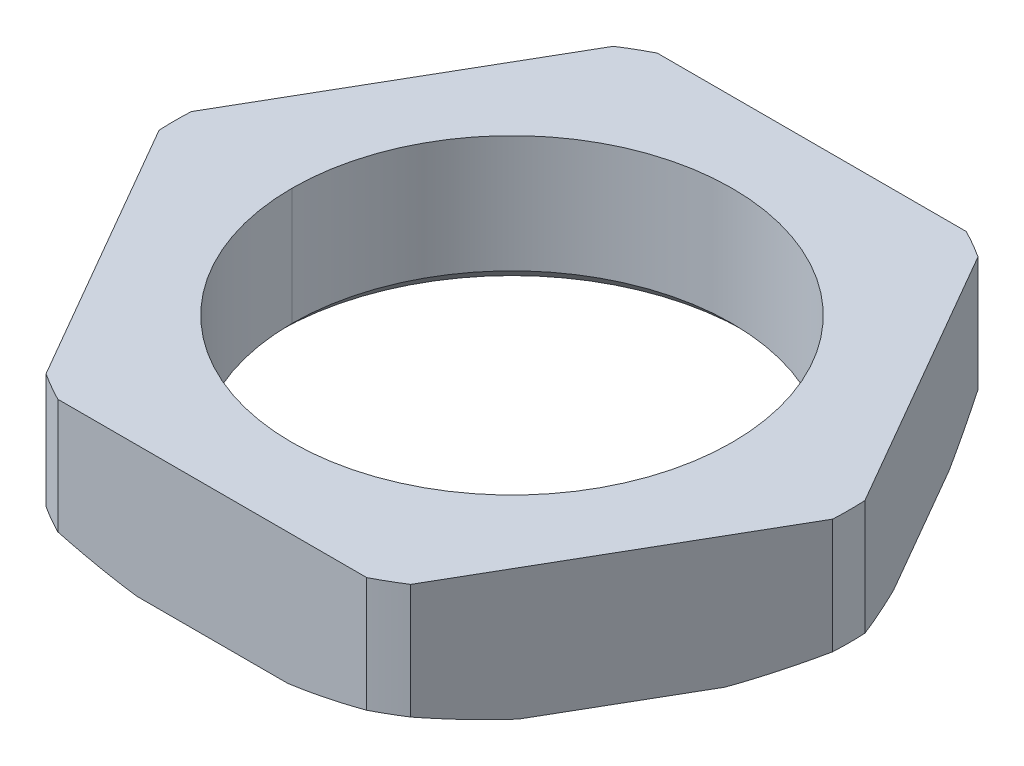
ISO-10303-21;
HEADER;
FILE_DESCRIPTION(('STEP AP214'),'2;1');
FILE_NAME('part.step','',(''),(''),'','','');
FILE_SCHEMA(('AUTOMOTIVE_DESIGN { 1 0 10303 214 1 1 1 1 }'));
ENDSEC;
DATA;
#1=APPLICATION_CONTEXT('core data for automotive mechanical design processes');
#2=APPLICATION_PROTOCOL_DEFINITION('international standard','automotive_design',2000,#1);
#3=PRODUCT_CONTEXT('',#1,'mechanical');
#4=PRODUCT('Part','Part','',(#3));
#5=PRODUCT_RELATED_PRODUCT_CATEGORY('part','',(#4));
#6=PRODUCT_DEFINITION_FORMATION('','',#4);
#7=PRODUCT_DEFINITION_CONTEXT('part definition',#1,'design');
#8=PRODUCT_DEFINITION('design','',#6,#7);
#9=PRODUCT_DEFINITION_SHAPE('','',#8);
#10=(LENGTH_UNIT() NAMED_UNIT(*) SI_UNIT(.MILLI.,.METRE.));
#11=(NAMED_UNIT(*) PLANE_ANGLE_UNIT() SI_UNIT($,.RADIAN.));
#12=(NAMED_UNIT(*) SI_UNIT($,.STERADIAN.) SOLID_ANGLE_UNIT());
#13=UNCERTAINTY_MEASURE_WITH_UNIT(LENGTH_MEASURE(1.E-05),#10,'distance_accuracy_value','');
#14=(GEOMETRIC_REPRESENTATION_CONTEXT(3) GLOBAL_UNCERTAINTY_ASSIGNED_CONTEXT((#13)) GLOBAL_UNIT_ASSIGNED_CONTEXT((#10,
#11,#12)) REPRESENTATION_CONTEXT('',''));
#15=CARTESIAN_POINT('',(0.,0.,0.));
#16=DIRECTION('',(0.,0.,1.));
#17=DIRECTION('',(1.,0.,0.));
#18=AXIS2_PLACEMENT_3D('',#15,#16,#17);
#19=CARTESIAN_POINT('',(0.,9.34123401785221,0.));
#20=DIRECTION('',(0.,1.,0.));
#21=DIRECTION('',(1.,0.,0.));
#22=AXIS2_PLACEMENT_3D('',#19,#20,#21);
#23=CONICAL_SURFACE('',#22,50.,1.0471975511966);
#24=CARTESIAN_POINT('',(-11.8408420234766,-9.99999999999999,-11.4910600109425));
#25=CARTESIAN_POINT('',(-11.7525857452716,-9.97510621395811,-11.6439179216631));
#26=CARTESIAN_POINT('',(-11.6644324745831,-9.94870526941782,-11.7965878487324));
#27=CARTESIAN_POINT('',(-11.4878805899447,-9.8928401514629,-12.1023559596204));
#28=CARTESIAN_POINT('',(-11.3994832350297,-9.86336015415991,-12.2554519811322));
#29=CARTESIAN_POINT('',(-11.2223159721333,-9.80133837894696,-12.5623156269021));
#30=CARTESIAN_POINT('',(-11.1335479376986,-9.76877616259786,-12.7160801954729));
#31=CARTESIAN_POINT('',(-10.9554968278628,-9.70059620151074,-13.0245042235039));
#32=CARTESIAN_POINT('',(-10.8662160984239,-9.66495407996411,-13.1791596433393));
#33=CARTESIAN_POINT('',(-10.690749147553,-9.59216920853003,-13.4830812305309));
#34=CARTESIAN_POINT('',(-10.6045546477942,-9.5551099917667,-13.6323626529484));
#35=CARTESIAN_POINT('',(-10.4317005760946,-9.47826049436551,-13.9317386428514));
#36=CARTESIAN_POINT('',(-10.3450433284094,-9.43844957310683,-14.0818292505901));
#37=CARTESIAN_POINT('',(-10.1711706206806,-9.35609995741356,-14.3829875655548));
#38=CARTESIAN_POINT('',(-10.0839578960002,-9.31353855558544,-14.5340506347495));
#39=CARTESIAN_POINT('',(-9.90888064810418,-9.22568968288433,-14.8373063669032));
#40=CARTESIAN_POINT('',(-9.82101918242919,-9.18037784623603,-14.9894937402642));
#41=CARTESIAN_POINT('',(-9.73330083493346,-9.13397459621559,-15.1414284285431));
#42=B_SPLINE_CURVE_WITH_KNOTS('',3,(#24,#25,#26,#27,#28,#29,#30,#31,#32,#33,#34,#35,#36,#37,#38,
#39,#40,#41),.UNSPECIFIED.,.F.,.F.,(4,2,2,2,2,2,2,2,4),(0.,0.53475236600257,1.07240246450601,
1.61390771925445,2.16018035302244,2.68911482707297,3.22257147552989,3.76120096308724,
4.30561448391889),.UNSPECIFIED.);
#43=CARTESIAN_POINT('',(-11.8408420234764,-10.,-11.4910600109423));
#44=VERTEX_POINT('',#43);
#45=CARTESIAN_POINT('',(-9.73330083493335,-9.13397459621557,-15.1414284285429));
#46=VERTEX_POINT('',#45);
#47=EDGE_CURVE('E639',#44,#46,#42,.T.);
#48=ORIENTED_EDGE('',*,*,#47,.T.);
#49=CARTESIAN_POINT('',(0.,-9.13397459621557,0.));
#50=DIRECTION('',(0.,-1.,0.));
#51=DIRECTION('',(1.,0.,0.));
#52=AXIS2_PLACEMENT_3D('',#49,#50,#51);
#53=CIRCLE('',#52,18.);
#54=CARTESIAN_POINT('',(-8.24621125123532,-9.13397459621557,-16.));
#55=VERTEX_POINT('',#54);
#56=EDGE_CURVE('E642',#46,#55,#53,.T.);
#57=ORIENTED_EDGE('',*,*,#56,.T.);
#58=CARTESIAN_POINT('',(-8.24621125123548,-9.13397459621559,-16.0000000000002));
#59=CARTESIAN_POINT('',(-8.07064932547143,-9.18041049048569,-15.9999989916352));
#60=CARTESIAN_POINT('',(-7.89479656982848,-9.22575332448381,-15.9999958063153));
#61=CARTESIAN_POINT('',(-7.54438070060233,-9.31366118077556,-15.9999898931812));
#62=CARTESIAN_POINT('',(-7.3698236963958,-9.3562505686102,-15.999987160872));
#63=CARTESIAN_POINT('',(-7.02182164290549,-9.43865311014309,-15.9999867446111));
#64=CARTESIAN_POINT('',(-6.84838197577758,-9.47848896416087,-15.9999890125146));
#65=CARTESIAN_POINT('',(-6.50242736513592,-9.55538547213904,-15.9999964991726));
#66=CARTESIAN_POINT('',(-6.32991700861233,-9.5924667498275,-16.0000016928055));
#67=CARTESIAN_POINT('',(-5.97898316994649,-9.66523594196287,-15.9999982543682));
#68=CARTESIAN_POINT('',(-5.80054315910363,-9.70084426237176,-15.9999891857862));
#69=CARTESIAN_POINT('',(-5.44468038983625,-9.7689615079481,-15.9999734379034));
#70=CARTESIAN_POINT('',(-5.26726227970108,-9.80149469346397,-15.9999667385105));
#71=CARTESIAN_POINT('',(-4.91318152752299,-9.86346347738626,-15.9999668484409));
#72=CARTESIAN_POINT('',(-4.73652244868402,-9.89291940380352,-15.9999735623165));
#73=CARTESIAN_POINT('',(-4.3836882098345,-9.94874139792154,-15.9999885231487));
#74=CARTESIAN_POINT('',(-4.20751553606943,-9.97512319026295,-15.9999967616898));
#75=CARTESIAN_POINT('',(-4.03112887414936,-9.99999999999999,-16.0000000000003));
#76=B_SPLINE_CURVE_WITH_KNOTS('',3,(#58,#59,#60,#61,#62,#63,#64,#65,#66,#67,#68,#69,#70,#71,#72,
#73,#74,#75),.UNSPECIFIED.,.F.,.F.,(4,2,2,2,2,2,2,2,4),(0.,0.544796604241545,1.08381372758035,
1.61766357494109,2.14699790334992,2.6928509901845,3.23395717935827,3.77122661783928,
4.30561449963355),.UNSPECIFIED.);
#77=CARTESIAN_POINT('',(-4.03112887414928,-10.,-16.));
#78=VERTEX_POINT('',#77);
#79=EDGE_CURVE('E461',#55,#78,#76,.T.);
#80=ORIENTED_EDGE('',*,*,#79,.T.);
#81=CARTESIAN_POINT('',(0.,-10.,0.));
#82=DIRECTION('',(0.,1.,0.));
#83=DIRECTION('',(1.,0.,0.));
#84=AXIS2_PLACEMENT_3D('',#81,#82,#83);
#85=CIRCLE('',#84,16.5);
#86=EDGE_CURVE('E437',#78,#44,#85,.T.);
#87=ORIENTED_EDGE('',*,*,#86,.T.);
#88=EDGE_LOOP('',(#48,#57,#80,#87));
#89=FACE_BOUND('',#88,.T.);
#90=ADVANCED_FACE('F15',(#89),#23,.T.);
#91=CARTESIAN_POINT('',(0.,9.34123401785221,0.));
#92=DIRECTION('',(0.,1.,0.));
#93=DIRECTION('',(1.,0.,0.));
#94=AXIS2_PLACEMENT_3D('',#91,#92,#93);
#95=CONICAL_SURFACE('',#94,50.,1.0471975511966);
#96=CARTESIAN_POINT('',(4.03112887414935,-9.99999999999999,-16.0000000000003));
#97=CARTESIAN_POINT('',(4.2044927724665,-9.97554947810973,-15.9999969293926));
#98=CARTESIAN_POINT('',(4.37765199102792,-9.94965752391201,-15.9999661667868));
#99=CARTESIAN_POINT('',(4.7242011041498,-9.89496824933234,-15.9998831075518));
#100=CARTESIAN_POINT('',(4.89758927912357,-9.86616002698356,-15.9998307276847));
#101=CARTESIAN_POINT('',(5.24484887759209,-9.80563960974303,-15.9997385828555));
#102=CARTESIAN_POINT('',(5.41871764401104,-9.77391218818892,-15.9996988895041));
#103=CARTESIAN_POINT('',(5.76718193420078,-9.70755842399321,-15.9996470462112));
#104=CARTESIAN_POINT('',(5.9417738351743,-9.67291307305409,-15.9996350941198));
#105=CARTESIAN_POINT('',(6.29191618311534,-9.60072684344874,-15.9996420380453));
#106=CARTESIAN_POINT('',(6.4674620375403,-9.56316371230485,-15.99966119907));
#107=CARTESIAN_POINT('',(6.81973260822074,-9.48514503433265,-15.9997221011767));
#108=CARTESIAN_POINT('',(6.99645179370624,-9.44466453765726,-15.9997640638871));
#109=CARTESIAN_POINT('',(7.35127696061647,-9.36081372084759,-15.9998531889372));
#110=CARTESIAN_POINT('',(7.52937652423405,-9.31741628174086,-15.9999004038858));
#111=CARTESIAN_POINT('',(7.88715957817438,-9.22773324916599,-15.999973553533));
#112=CARTESIAN_POINT('',(8.06683585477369,-9.1814188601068,-15.9999992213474));
#113=CARTESIAN_POINT('',(8.24621125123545,-9.13397459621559,-16.0000000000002));
#114=B_SPLINE_CURVE_WITH_KNOTS('',3,(#96,#97,#98,#99,#100,#101,#102,#103,#104,#105,#106,#107,
#108,#109,#110,#111,#112,#113),.UNSPECIFIED.,.F.,.F.,(4,2,2,2,2,2,2,2,4),(0.,0.525230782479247,
1.05250313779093,1.58270123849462,2.11666923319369,2.6552092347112,3.19907990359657,
3.74899560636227,4.30562610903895),.UNSPECIFIED.);
#115=CARTESIAN_POINT('',(4.03112887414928,-10.,-16.));
#116=VERTEX_POINT('',#115);
#117=CARTESIAN_POINT('',(8.24621125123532,-9.13397459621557,-16.));
#118=VERTEX_POINT('',#117);
#119=EDGE_CURVE('E460',#116,#118,#114,.T.);
#120=ORIENTED_EDGE('',*,*,#119,.T.);
#121=CARTESIAN_POINT('',(0.,-9.13397459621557,0.));
#122=DIRECTION('',(0.,-1.,0.));
#123=DIRECTION('',(1.,0.,0.));
#124=AXIS2_PLACEMENT_3D('',#121,#122,#123);
#125=CIRCLE('',#124,18.);
#126=CARTESIAN_POINT('',(9.73330083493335,-9.13397459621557,-15.1414284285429));
#127=VERTEX_POINT('',#126);
#128=EDGE_CURVE('E517',#118,#127,#125,.T.);
#129=ORIENTED_EDGE('',*,*,#128,.T.);
#130=CARTESIAN_POINT('',(9.7333008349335,-9.13397459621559,-15.1414284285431));
#131=CARTESIAN_POINT('',(9.82298785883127,-9.1814188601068,-14.9860843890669));
#132=CARTESIAN_POINT('',(9.91280376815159,-9.22773324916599,-14.8304673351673));
#133=CARTESIAN_POINT('',(10.0916319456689,-9.31741628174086,-14.5205815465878));
#134=CARTESIAN_POINT('',(10.1806408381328,-9.36081372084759,-14.3663191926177));
#135=CARTESIAN_POINT('',(10.3579762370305,-9.44466453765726,-14.0589870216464));
#136=CARTESIAN_POINT('',(10.446299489,-9.48514503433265,-13.9059227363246));
#137=CARTESIAN_POINT('',(10.6223820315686,-9.56316371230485,-13.6008170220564));
#138=CARTESIAN_POINT('',(10.710138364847,-9.60072684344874,-13.448780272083));
#139=CARTESIAN_POINT('',(10.8852035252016,-9.67291307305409,-13.1455446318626));
#140=CARTESIAN_POINT('',(10.9725098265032,-9.70755842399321,-12.9943495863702));
#141=CARTESIAN_POINT('',(11.1467868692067,-9.77391218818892,-12.6925965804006));
#142=CARTESIAN_POINT('',(11.2337556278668,-9.80563960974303,-12.5420416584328));
#143=CARTESIAN_POINT('',(11.407465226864,-9.86616002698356,-12.2413520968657));
#144=CARTESIAN_POINT('',(11.4942046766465,-9.89496824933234,-12.0912197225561));
#145=CARTESIAN_POINT('',(11.6675511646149,-9.94965752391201,-11.7911409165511));
#146=CARTESIAN_POINT('',(11.7541574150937,-9.97554947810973,-11.6411960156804));
#147=CARTESIAN_POINT('',(11.8408420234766,-9.99999999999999,-11.4910600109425));
#148=B_SPLINE_CURVE_WITH_KNOTS('',3,(#130,#131,#132,#133,#134,#135,#136,#137,#138,#139,#140,
#141,#142,#143,#144,#145,#146,#147),.UNSPECIFIED.,.F.,.F.,(4,2,2,2,2,2,2,2,4),(0.,
0.556630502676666,1.10654620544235,1.65041687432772,2.18895687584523,2.7229248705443,
3.25312297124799,3.78039532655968,4.30562610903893),.UNSPECIFIED.);
#149=CARTESIAN_POINT('',(11.8408420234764,-10.,-11.4910600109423));
#150=VERTEX_POINT('',#149);
#151=EDGE_CURVE('E324',#127,#150,#148,.T.);
#152=ORIENTED_EDGE('',*,*,#151,.T.);
#153=CARTESIAN_POINT('',(0.,-10.,0.));
#154=DIRECTION('',(0.,1.,0.));
#155=DIRECTION('',(1.,0.,0.));
#156=AXIS2_PLACEMENT_3D('',#153,#154,#155);
#157=CIRCLE('',#156,16.5);
#158=EDGE_CURVE('E424',#150,#116,#157,.T.);
#159=ORIENTED_EDGE('',*,*,#158,.T.);
#160=EDGE_LOOP('',(#120,#129,#152,#159));
#161=FACE_BOUND('',#160,.T.);
#162=ADVANCED_FACE('F545',(#161),#95,.T.);
#163=CARTESIAN_POINT('',(0.,9.34123401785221,0.));
#164=DIRECTION('',(0.,1.,0.));
#165=DIRECTION('',(1.,0.,0.));
#166=AXIS2_PLACEMENT_3D('',#163,#164,#165);
#167=CONICAL_SURFACE('',#166,50.,1.0471975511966);
#168=CARTESIAN_POINT('',(-17.9795120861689,-9.13397459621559,-0.858571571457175));
#169=CARTESIAN_POINT('',(-17.889823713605,-9.1814188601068,-1.01391483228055));
#170=CARTESIAN_POINT('',(-17.799963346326,-9.22773324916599,-1.16950621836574));
#171=CARTESIAN_POINT('',(-17.621008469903,-9.31741628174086,-1.47931885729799));
#172=CARTESIAN_POINT('',(-17.5319177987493,-9.36081372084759,-1.63353399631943));
#173=CARTESIAN_POINT('',(-17.3544280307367,-9.44466453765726,-1.9407770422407));
#174=CARTESIAN_POINT('',(-17.2660320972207,-9.48514503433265,-2.09379936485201));
#175=CARTESIAN_POINT('',(-17.089844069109,-9.56316371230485,-2.39884417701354));
#176=CARTESIAN_POINT('',(-17.0020545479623,-9.60072684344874,-2.55086176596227));
#177=CARTESIAN_POINT('',(-16.826977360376,-9.67291307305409,-2.85409046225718));
#178=CARTESIAN_POINT('',(-16.739691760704,-9.70755842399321,-3.00529745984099));
#179=CARTESIAN_POINT('',(-16.5655045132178,-9.77391218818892,-3.30710230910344));
#180=CARTESIAN_POINT('',(-16.4786045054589,-9.80563960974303,-3.4576969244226));
#181=CARTESIAN_POINT('',(-16.3050545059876,-9.86616002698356,-3.75847863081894));
#182=CARTESIAN_POINT('',(-16.2184057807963,-9.89496824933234,-3.90866338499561));
#183=CARTESIAN_POINT('',(-16.0452031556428,-9.94965752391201,-4.20882525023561));
#184=CARTESIAN_POINT('',(-15.9586501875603,-9.97554947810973,-4.35880091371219));
#185=CARTESIAN_POINT('',(-15.871970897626,-9.99999999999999,-4.50893998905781));
#186=B_SPLINE_CURVE_WITH_KNOTS('',3,(#168,#169,#170,#171,#172,#173,#174,#175,#176,#177,#178,
#179,#180,#181,#182,#183,#184,#185),.UNSPECIFIED.,.F.,.F.,(4,2,2,2,2,2,2,2,4),(0.,
0.55663050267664,1.10654620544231,1.65041687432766,2.18895687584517,2.72292487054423,
3.25312297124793,3.78039532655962,4.30562610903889),.UNSPECIFIED.);
#187=CARTESIAN_POINT('',(-17.9795120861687,-9.13397459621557,-0.858571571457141));
#188=VERTEX_POINT('',#187);
#189=CARTESIAN_POINT('',(-15.8719708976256,-10.,-4.50893998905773));
#190=VERTEX_POINT('',#189);
#191=EDGE_CURVE('E655',#188,#190,#186,.T.);
#192=ORIENTED_EDGE('',*,*,#191,.T.);
#193=CARTESIAN_POINT('',(0.,-10.,0.));
#194=DIRECTION('',(0.,1.,0.));
#195=DIRECTION('',(1.,0.,0.));
#196=AXIS2_PLACEMENT_3D('',#193,#194,#195);
#197=CIRCLE('',#196,16.5);
#198=CARTESIAN_POINT('',(-15.8719708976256,-10.,4.50893998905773));
#199=VERTEX_POINT('',#198);
#200=EDGE_CURVE('E707',#190,#199,#197,.T.);
#201=ORIENTED_EDGE('',*,*,#200,.T.);
#202=CARTESIAN_POINT('',(-15.871970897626,-9.99999999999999,4.50893998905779));
#203=CARTESIAN_POINT('',(-15.960221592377,-9.97510621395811,4.3560788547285));
#204=CARTESIAN_POINT('',(-16.0483609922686,-9.94870526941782,4.20340091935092));
#205=CARTESIAN_POINT('',(-16.2248880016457,-9.8928401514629,3.89761844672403));
#206=CARTESIAN_POINT('',(-16.3132743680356,-9.86336015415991,3.74451608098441));
#207=CARTESIAN_POINT('',(-16.4904424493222,-9.80133837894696,3.43765290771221));
#208=CARTESIAN_POINT('',(-16.579222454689,-9.76877616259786,3.28389525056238));
#209=CARTESIAN_POINT('',(-16.7572999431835,-9.70059620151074,2.97548645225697));
#210=CARTESIAN_POINT('',(-16.8465951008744,-9.66495407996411,2.82083936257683));
#211=CARTESIAN_POINT('',(-17.0220654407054,-9.59216920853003,2.51691973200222));
#212=CARTESIAN_POINT('',(-17.1082496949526,-9.5551099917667,2.36763239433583));
#213=CARTESIAN_POINT('',(-17.2810898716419,-9.47826049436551,2.06824838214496));
#214=CARTESIAN_POINT('',(-17.3677435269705,-9.43844957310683,1.91815570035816));
#215=CARTESIAN_POINT('',(-17.5416179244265,-9.35609995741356,1.61699836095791));
#216=CARTESIAN_POINT('',(-17.6288360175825,-9.31353855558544,1.46593839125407));
#217=CARTESIAN_POINT('',(-17.8039245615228,-9.22568968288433,1.16268918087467));
#218=CARTESIAN_POINT('',(-17.8917919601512,-9.18037784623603,1.0105052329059));
#219=CARTESIAN_POINT('',(-17.979512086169,-9.13397459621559,0.858571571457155));
#220=B_SPLINE_CURVE_WITH_KNOTS('',3,(#202,#203,#204,#205,#206,#207,#208,#209,#210,#211,#212,
#213,#214,#215,#216,#217,#218,#219),.UNSPECIFIED.,.F.,.F.,(4,2,2,2,2,2,2,2,4),(0.,
0.534752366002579,1.07240246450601,1.61390771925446,2.16018035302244,2.68911482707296,
3.22257147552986,3.76120096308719,4.30561448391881),.UNSPECIFIED.);
#221=CARTESIAN_POINT('',(-17.9795120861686,-9.13397459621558,0.858571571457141));
#222=VERTEX_POINT('',#221);
#223=EDGE_CURVE('E238',#199,#222,#220,.T.);
#224=ORIENTED_EDGE('',*,*,#223,.T.);
#225=CARTESIAN_POINT('',(0.,-9.13397459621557,0.));
#226=DIRECTION('',(0.,-1.,0.));
#227=DIRECTION('',(1.,0.,0.));
#228=AXIS2_PLACEMENT_3D('',#225,#226,#227);
#229=CIRCLE('',#228,18.);
#230=EDGE_CURVE('E427',#222,#188,#229,.T.);
#231=ORIENTED_EDGE('',*,*,#230,.T.);
#232=EDGE_LOOP('',(#192,#201,#224,#231));
#233=FACE_BOUND('',#232,.T.);
#234=ADVANCED_FACE('F554',(#233),#167,.T.);
#235=CARTESIAN_POINT('',(0.,9.34123401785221,0.));
#236=DIRECTION('',(0.,1.,0.));
#237=DIRECTION('',(1.,0.,0.));
#238=AXIS2_PLACEMENT_3D('',#235,#236,#237);
#239=CONICAL_SURFACE('',#238,50.,1.0471975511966);
#240=CARTESIAN_POINT('',(-9.73330083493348,-9.13397459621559,15.1414284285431));
#241=CARTESIAN_POINT('',(-9.82298785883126,-9.1814188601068,14.9860843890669));
#242=CARTESIAN_POINT('',(-9.91280376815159,-9.22773324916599,14.8304673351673));
#243=CARTESIAN_POINT('',(-10.0916319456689,-9.31741628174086,14.5205815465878));
#244=CARTESIAN_POINT('',(-10.1806408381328,-9.36081372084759,14.3663191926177));
#245=CARTESIAN_POINT('',(-10.3579762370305,-9.44466453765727,14.0589870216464));
#246=CARTESIAN_POINT('',(-10.446299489,-9.48514503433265,13.9059227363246));
#247=CARTESIAN_POINT('',(-10.6223820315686,-9.56316371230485,13.6008170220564));
#248=CARTESIAN_POINT('',(-10.710138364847,-9.60072684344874,13.448780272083));
#249=CARTESIAN_POINT('',(-10.8852035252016,-9.67291307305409,13.1455446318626));
#250=CARTESIAN_POINT('',(-10.9725098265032,-9.70755842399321,12.9943495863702));
#251=CARTESIAN_POINT('',(-11.1467868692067,-9.77391218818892,12.6925965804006));
#252=CARTESIAN_POINT('',(-11.2337556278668,-9.80563960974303,12.5420416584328));
#253=CARTESIAN_POINT('',(-11.407465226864,-9.86616002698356,12.2413520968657));
#254=CARTESIAN_POINT('',(-11.4942046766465,-9.89496824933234,12.0912197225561));
#255=CARTESIAN_POINT('',(-11.6675511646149,-9.94965752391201,11.7911409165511));
#256=CARTESIAN_POINT('',(-11.7541574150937,-9.97554947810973,11.6411960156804));
#257=CARTESIAN_POINT('',(-11.8408420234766,-9.99999999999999,11.4910600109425));
#258=B_SPLINE_CURVE_WITH_KNOTS('',3,(#240,#241,#242,#243,#244,#245,#246,#247,#248,#249,#250,
#251,#252,#253,#254,#255,#256,#257),.UNSPECIFIED.,.F.,.F.,(4,2,2,2,2,2,2,2,4),(0.,
0.556630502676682,1.10654620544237,1.65041687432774,2.18895687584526,2.72292487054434,
3.25312297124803,3.78039532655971,4.30562610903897),.UNSPECIFIED.);
#259=CARTESIAN_POINT('',(-9.73330083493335,-9.13397459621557,15.1414284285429));
#260=VERTEX_POINT('',#259);
#261=CARTESIAN_POINT('',(-11.8408420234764,-10.,11.4910600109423));
#262=VERTEX_POINT('',#261);
#263=EDGE_CURVE('E525',#260,#262,#258,.T.);
#264=ORIENTED_EDGE('',*,*,#263,.T.);
#265=CARTESIAN_POINT('',(0.,-10.,0.));
#266=DIRECTION('',(0.,1.,0.));
#267=DIRECTION('',(1.,0.,0.));
#268=AXIS2_PLACEMENT_3D('',#265,#266,#267);
#269=CIRCLE('',#268,16.5);
#270=CARTESIAN_POINT('',(-4.03112887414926,-10.,16.));
#271=VERTEX_POINT('',#270);
#272=EDGE_CURVE('E212',#262,#271,#269,.T.);
#273=ORIENTED_EDGE('',*,*,#272,.T.);
#274=CARTESIAN_POINT('',(-4.03112887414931,-9.99999999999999,16.0000000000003));
#275=CARTESIAN_POINT('',(-4.20449277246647,-9.97554947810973,15.9999969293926));
#276=CARTESIAN_POINT('',(-4.3776519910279,-9.94965752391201,15.9999661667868));
#277=CARTESIAN_POINT('',(-4.72420110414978,-9.89496824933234,15.9998831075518));
#278=CARTESIAN_POINT('',(-4.89758927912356,-9.86616002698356,15.9998307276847));
#279=CARTESIAN_POINT('',(-5.24484887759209,-9.80563960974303,15.9997385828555));
#280=CARTESIAN_POINT('',(-5.41871764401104,-9.77391218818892,15.9996988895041));
#281=CARTESIAN_POINT('',(-5.76718193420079,-9.70755842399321,15.9996470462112));
#282=CARTESIAN_POINT('',(-5.94177383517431,-9.67291307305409,15.9996350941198));
#283=CARTESIAN_POINT('',(-6.29191618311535,-9.60072684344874,15.9996420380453));
#284=CARTESIAN_POINT('',(-6.46746203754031,-9.56316371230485,15.99966119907));
#285=CARTESIAN_POINT('',(-6.81973260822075,-9.48514503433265,15.9997221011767));
#286=CARTESIAN_POINT('',(-6.99645179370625,-9.44466453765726,15.9997640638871));
#287=CARTESIAN_POINT('',(-7.35127696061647,-9.36081372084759,15.9998531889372));
#288=CARTESIAN_POINT('',(-7.52937652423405,-9.31741628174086,15.9999004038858));
#289=CARTESIAN_POINT('',(-7.88715957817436,-9.22773324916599,15.9999735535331));
#290=CARTESIAN_POINT('',(-8.06683585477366,-9.1814188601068,15.9999992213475));
#291=CARTESIAN_POINT('',(-8.24621125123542,-9.13397459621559,16.0000000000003));
#292=B_SPLINE_CURVE_WITH_KNOTS('',3,(#274,#275,#276,#277,#278,#279,#280,#281,#282,#283,#284,
#285,#286,#287,#288,#289,#290,#291),.UNSPECIFIED.,.F.,.F.,(4,2,2,2,2,2,2,2,4),(0.,
0.525230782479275,1.05250313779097,1.58270123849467,2.11666923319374,2.65520923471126,
3.19907990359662,3.74899560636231,4.30562610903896),.UNSPECIFIED.);
#293=CARTESIAN_POINT('',(-8.24621125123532,-9.13397459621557,16.));
#294=VERTEX_POINT('',#293);
#295=EDGE_CURVE('E204',#271,#294,#292,.T.);
#296=ORIENTED_EDGE('',*,*,#295,.T.);
#297=CARTESIAN_POINT('',(0.,-9.13397459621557,0.));
#298=DIRECTION('',(0.,-1.,0.));
#299=DIRECTION('',(1.,0.,0.));
#300=AXIS2_PLACEMENT_3D('',#297,#298,#299);
#301=CIRCLE('',#300,18.);
#302=EDGE_CURVE('E209',#294,#260,#301,.T.);
#303=ORIENTED_EDGE('',*,*,#302,.T.);
#304=EDGE_LOOP('',(#264,#273,#296,#303));
#305=FACE_BOUND('',#304,.T.);
#306=ADVANCED_FACE('F207',(#305),#239,.T.);
#307=CARTESIAN_POINT('',(0.,9.34123401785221,0.));
#308=DIRECTION('',(0.,1.,0.));
#309=DIRECTION('',(1.,0.,0.));
#310=AXIS2_PLACEMENT_3D('',#307,#308,#309);
#311=CONICAL_SURFACE('',#310,50.,1.0471975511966);
#312=DIRECTION('',(0.866025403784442,0.5,0.));
#313=VECTOR('',#312,1.);
#314=CARTESIAN_POINT('',(50.,9.34123401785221,0.));
#315=LINE('',#314,#313);
#316=CARTESIAN_POINT('',(16.5,-10.,0.));
#317=VERTEX_POINT('',#316);
#318=CARTESIAN_POINT('',(18.,-9.13397459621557,0.));
#319=VERTEX_POINT('',#318);
#320=EDGE_CURVE('E333',#317,#319,#315,.T.);
#321=ORIENTED_EDGE('',*,*,#320,.F.);
#322=CARTESIAN_POINT('',(0.,-10.,0.));
#323=DIRECTION('',(0.,1.,0.));
#324=DIRECTION('',(1.,0.,0.));
#325=AXIS2_PLACEMENT_3D('',#322,#323,#324);
#326=CIRCLE('',#325,16.5);
#327=CARTESIAN_POINT('',(15.8719708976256,-10.,-4.50893998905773));
#328=VERTEX_POINT('',#327);
#329=EDGE_CURVE('E580',#317,#328,#326,.T.);
#330=ORIENTED_EDGE('',*,*,#329,.T.);
#331=CARTESIAN_POINT('',(15.871970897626,-9.99999999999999,-4.50893998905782));
#332=CARTESIAN_POINT('',(15.9602215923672,-9.97510621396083,-4.35607885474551));
#333=CARTESIAN_POINT('',(16.0483609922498,-9.94870526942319,-4.20340091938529));
#334=CARTESIAN_POINT('',(16.2248880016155,-9.89284015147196,-3.89761844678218));
#335=CARTESIAN_POINT('',(16.3132743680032,-9.86336015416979,-3.744516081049));
#336=CARTESIAN_POINT('',(16.4904424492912,-9.80133837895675,-3.43765290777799));
#337=CARTESIAN_POINT('',(16.5792224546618,-9.76877616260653,-3.28389525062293));
#338=CARTESIAN_POINT('',(16.7572999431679,-9.70059620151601,-2.97548645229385));
#339=CARTESIAN_POINT('',(16.8465951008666,-9.6649540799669,-2.82083936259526));
#340=CARTESIAN_POINT('',(17.0220654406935,-9.59216920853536,-2.516919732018));
#341=CARTESIAN_POINT('',(17.108249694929,-9.55510999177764,-2.36763239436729));
#342=CARTESIAN_POINT('',(17.2810898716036,-9.47826049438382,-2.06824838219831));
#343=CARTESIAN_POINT('',(17.3677435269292,-9.43844957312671,-1.91815570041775));
#344=CARTESIAN_POINT('',(17.5416179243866,-9.35609995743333,-1.61699836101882));
#345=CARTESIAN_POINT('',(17.6288360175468,-9.31353855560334,-1.4659383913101));
#346=CARTESIAN_POINT('',(17.8039245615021,-9.2256896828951,-1.16268918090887));
#347=CARTESIAN_POINT('',(17.8917919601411,-9.18037784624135,-1.01050523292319));
#348=CARTESIAN_POINT('',(17.979512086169,-9.13397459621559,-0.858571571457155));
#349=B_SPLINE_CURVE_WITH_KNOTS('',3,(#331,#332,#333,#334,#335,#336,#337,#338,#339,#340,#341,
#342,#343,#344,#345,#346,#347,#348),.UNSPECIFIED.,.F.,.F.,(4,2,2,2,2,2,2,2,4),(0.,
0.534752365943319,1.07240246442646,1.61390771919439,2.16018035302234,2.68911482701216,
3.22257147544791,3.76120096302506,4.30561448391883),.UNSPECIFIED.);
#350=CARTESIAN_POINT('',(17.9795120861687,-9.13397459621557,-0.858571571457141));
#351=VERTEX_POINT('',#350);
#352=EDGE_CURVE('E526',#328,#351,#349,.T.);
#353=ORIENTED_EDGE('',*,*,#352,.T.);
#354=CARTESIAN_POINT('',(0.,-9.13397459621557,0.));
#355=DIRECTION('',(0.,-1.,0.));
#356=DIRECTION('',(1.,0.,0.));
#357=AXIS2_PLACEMENT_3D('',#354,#355,#356);
#358=CIRCLE('',#357,18.);
#359=EDGE_CURVE('E569',#351,#319,#358,.T.);
#360=ORIENTED_EDGE('',*,*,#359,.T.);
#361=EDGE_LOOP('',(#321,#330,#353,#360));
#362=FACE_BOUND('',#361,.T.);
#363=ADVANCED_FACE('F267',(#362),#311,.T.);
#364=CARTESIAN_POINT('',(0.,9.34123401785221,0.));
#365=DIRECTION('',(0.,1.,0.));
#366=DIRECTION('',(1.,0.,0.));
#367=AXIS2_PLACEMENT_3D('',#364,#365,#366);
#368=CONICAL_SURFACE('',#367,50.,1.0471975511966);
#369=CARTESIAN_POINT('',(8.2462112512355,-9.13397459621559,16.0000000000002));
#370=CARTESIAN_POINT('',(8.07064932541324,-9.18041049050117,15.999998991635));
#371=CARTESIAN_POINT('',(7.89479656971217,-9.22575332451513,15.9999958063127));
#372=CARTESIAN_POINT('',(7.5443807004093,-9.31366118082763,15.9999898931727));
#373=CARTESIAN_POINT('',(7.36982369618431,-9.35625056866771,15.9999871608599));
#374=CARTESIAN_POINT('',(7.02182164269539,-9.43865311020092,15.9999867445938));
#375=CARTESIAN_POINT('',(6.84838197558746,-9.47848896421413,15.9999890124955));
#376=CARTESIAN_POINT('',(6.50242736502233,-9.55538547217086,15.9999964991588));
#377=CARTESIAN_POINT('',(6.32991700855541,-9.59246674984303,16.0000016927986));
#378=CARTESIAN_POINT('',(5.97898316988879,-9.66523594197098,15.9999982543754));
#379=CARTESIAN_POINT('',(5.80054315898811,-9.70084426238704,15.9999891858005));
#380=CARTESIAN_POINT('',(5.44468038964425,-9.76896150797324,15.999973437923));
#381=CARTESIAN_POINT('',(5.26726227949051,-9.80149469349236,15.9999667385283));
#382=CARTESIAN_POINT('',(4.91318152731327,-9.86346347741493,15.9999668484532));
#383=CARTESIAN_POINT('',(4.73652244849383,-9.8929194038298,15.9999735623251));
#384=CARTESIAN_POINT('',(4.38368820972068,-9.94874139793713,15.9999885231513));
#385=CARTESIAN_POINT('',(4.20751553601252,-9.97512319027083,15.9999967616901));
#386=CARTESIAN_POINT('',(4.03112887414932,-9.99999999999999,16.0000000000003));
#387=B_SPLINE_CURVE_WITH_KNOTS('',3,(#369,#370,#371,#372,#373,#374,#375,#376,#377,#378,#379,
#380,#381,#382,#383,#384,#385,#386),.UNSPECIFIED.,.F.,.F.,(4,2,2,2,2,2,2,2,4),(0.,
0.544796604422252,1.08381372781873,1.61766357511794,2.14699790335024,2.69285099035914,
3.23395717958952,3.77122661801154,4.30561449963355),.UNSPECIFIED.);
#388=CARTESIAN_POINT('',(8.24621125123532,-9.13397459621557,16.));
#389=VERTEX_POINT('',#388);
#390=CARTESIAN_POINT('',(4.03112887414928,-10.,16.));
#391=VERTEX_POINT('',#390);
#392=EDGE_CURVE('E232',#389,#391,#387,.T.);
#393=ORIENTED_EDGE('',*,*,#392,.T.);
#394=CARTESIAN_POINT('',(0.,-10.,0.));
#395=DIRECTION('',(0.,1.,0.));
#396=DIRECTION('',(1.,0.,0.));
#397=AXIS2_PLACEMENT_3D('',#394,#395,#396);
#398=CIRCLE('',#397,16.5);
#399=CARTESIAN_POINT('',(11.8408420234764,-10.,11.4910600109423));
#400=VERTEX_POINT('',#399);
#401=EDGE_CURVE('E291',#391,#400,#398,.T.);
#402=ORIENTED_EDGE('',*,*,#401,.T.);
#403=CARTESIAN_POINT('',(11.8408420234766,-9.99999999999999,11.4910600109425));
#404=CARTESIAN_POINT('',(11.7525857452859,-9.97510621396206,11.6439179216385));
#405=CARTESIAN_POINT('',(11.6644324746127,-9.94870526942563,11.7965878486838));
#406=CARTESIAN_POINT('',(11.487880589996,-9.89284015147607,12.1023559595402));
#407=CARTESIAN_POINT('',(11.3994832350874,-9.86336015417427,12.2554519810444));
#408=CARTESIAN_POINT('',(11.2223159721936,-9.80133837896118,12.5623156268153));
#409=CARTESIAN_POINT('',(11.1335479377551,-9.76877616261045,12.7160801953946));
#410=CARTESIAN_POINT('',(10.9554968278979,-9.70059620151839,13.0245042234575));
#411=CARTESIAN_POINT('',(10.8662160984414,-9.66495407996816,13.1791596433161));
#412=CARTESIAN_POINT('',(10.6907491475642,-9.59216920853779,13.4830812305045));
#413=CARTESIAN_POINT('',(10.6045546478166,-9.55510999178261,13.6323626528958));
#414=CARTESIAN_POINT('',(10.4317005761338,-9.47826049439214,13.9317386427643));
#415=CARTESIAN_POINT('',(10.3450433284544,-9.43844957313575,14.0818292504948));
#416=CARTESIAN_POINT('',(10.1711706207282,-9.35609995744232,14.3829875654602));
#417=CARTESIAN_POINT('',(10.0839578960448,-9.31353855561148,14.5340506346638));
#418=CARTESIAN_POINT('',(9.90888064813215,-9.22568968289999,14.8373063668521));
#419=CARTESIAN_POINT('',(9.82101918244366,-9.18037784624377,14.9894937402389));
#420=CARTESIAN_POINT('',(9.73330083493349,-9.13397459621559,15.1414284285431));
#421=B_SPLINE_CURVE_WITH_KNOTS('',3,(#403,#404,#405,#406,#407,#408,#409,#410,#411,#412,#413,
#414,#415,#416,#417,#418,#419,#420),.UNSPECIFIED.,.F.,.F.,(4,2,2,2,2,2,2,2,4),(0.,
0.534752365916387,1.07240246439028,1.61390771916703,2.16018035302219,2.68911482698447,
3.22257147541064,3.7612009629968,4.30561448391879),.UNSPECIFIED.);
#422=CARTESIAN_POINT('',(9.73330083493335,-9.13397459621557,15.1414284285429));
#423=VERTEX_POINT('',#422);
#424=EDGE_CURVE('E286',#400,#423,#421,.T.);
#425=ORIENTED_EDGE('',*,*,#424,.T.);
#426=CARTESIAN_POINT('',(0.,-9.13397459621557,0.));
#427=DIRECTION('',(0.,-1.,0.));
#428=DIRECTION('',(1.,0.,0.));
#429=AXIS2_PLACEMENT_3D('',#426,#427,#428);
#430=CIRCLE('',#429,18.);
#431=EDGE_CURVE('E26',#423,#389,#430,.T.);
#432=ORIENTED_EDGE('',*,*,#431,.T.);
#433=EDGE_LOOP('',(#393,#402,#425,#432));
#434=FACE_BOUND('',#433,.T.);
#435=ADVANCED_FACE('F256',(#434),#368,.T.);
#436=CARTESIAN_POINT('',(0.,-9.25,0.));
#437=DIRECTION('',(0.,-1.,0.));
#438=DIRECTION('',(-1.,0.,0.));
#439=AXIS2_PLACEMENT_3D('',#436,#437,#438);
#440=CONICAL_SURFACE('',#439,11.75,0.785398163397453);
#441=DIRECTION('',(0.707106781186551,-0.707106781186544,0.));
#442=VECTOR('',#441,1.);
#443=CARTESIAN_POINT('',(11.75,-9.25,0.));
#444=LINE('',#443,#442);
#445=CARTESIAN_POINT('',(11.75,-9.25,0.));
#446=VERTEX_POINT('',#445);
#447=CARTESIAN_POINT('',(12.5,-10.,0.));
#448=VERTEX_POINT('',#447);
#449=EDGE_CURVE('E357',#446,#448,#444,.T.);
#450=ORIENTED_EDGE('',*,*,#449,.F.);
#451=CARTESIAN_POINT('',(0.,-9.25,0.));
#452=DIRECTION('',(0.,-1.,0.));
#453=DIRECTION('',(1.,0.,0.));
#454=AXIS2_PLACEMENT_3D('',#451,#452,#453);
#455=CIRCLE('',#454,11.75);
#456=CARTESIAN_POINT('',(-11.75,-9.25,0.));
#457=VERTEX_POINT('',#456);
#458=EDGE_CURVE('E10',#457,#446,#455,.T.);
#459=ORIENTED_EDGE('',*,*,#458,.F.);
#460=DIRECTION('',(-0.707106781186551,-0.707106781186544,0.));
#461=VECTOR('',#460,1.);
#462=CARTESIAN_POINT('',(-11.75,-9.25,0.));
#463=LINE('',#462,#461);
#464=CARTESIAN_POINT('',(-12.5,-10.,0.));
#465=VERTEX_POINT('',#464);
#466=EDGE_CURVE('E365',#457,#465,#463,.T.);
#467=ORIENTED_EDGE('',*,*,#466,.T.);
#468=CARTESIAN_POINT('',(0.,-10.,0.));
#469=DIRECTION('',(0.,1.,0.));
#470=DIRECTION('',(1.,0.,0.));
#471=AXIS2_PLACEMENT_3D('',#468,#469,#470);
#472=CIRCLE('',#471,12.5);
#473=EDGE_CURVE('E425',#448,#465,#472,.T.);
#474=ORIENTED_EDGE('',*,*,#473,.F.);
#475=EDGE_LOOP('',(#450,#459,#467,#474));
#476=FACE_BOUND('',#475,.T.);
#477=ADVANCED_FACE('F266',(#476),#440,.F.);
#478=CARTESIAN_POINT('',(0.,-10.,0.));
#479=DIRECTION('',(0.,1.,0.));
#480=DIRECTION('',(1.,0.,0.));
#481=AXIS2_PLACEMENT_3D('',#478,#479,#480);
#482=CYLINDRICAL_SURFACE('',#481,11.75);
#483=DIRECTION('',(0.,1.,0.));
#484=VECTOR('',#483,1.);
#485=CARTESIAN_POINT('',(-11.75,-10.,0.));
#486=LINE('',#485,#484);
#487=CARTESIAN_POINT('',(-11.75,-3.,0.));
#488=VERTEX_POINT('',#487);
#489=EDGE_CURVE('E369',#457,#488,#486,.T.);
#490=ORIENTED_EDGE('',*,*,#489,.F.);
#491=ORIENTED_EDGE('',*,*,#458,.T.);
#492=DIRECTION('',(0.,1.,0.));
#493=VECTOR('',#492,1.);
#494=CARTESIAN_POINT('',(11.75,-10.,0.));
#495=LINE('',#494,#493);
#496=CARTESIAN_POINT('',(11.75,-3.,0.));
#497=VERTEX_POINT('',#496);
#498=EDGE_CURVE('E377',#446,#497,#495,.T.);
#499=ORIENTED_EDGE('',*,*,#498,.T.);
#500=CARTESIAN_POINT('',(0.,-3.,0.));
#501=DIRECTION('',(0.,1.,0.));
#502=DIRECTION('',(1.,0.,0.));
#503=AXIS2_PLACEMENT_3D('',#500,#501,#502);
#504=CIRCLE('',#503,11.75);
#505=EDGE_CURVE('E421',#497,#488,#504,.T.);
#506=ORIENTED_EDGE('',*,*,#505,.T.);
#507=EDGE_LOOP('',(#490,#491,#499,#506));
#508=FACE_BOUND('',#507,.T.);
#509=ADVANCED_FACE('F816',(#508),#482,.F.);
#510=CARTESIAN_POINT('',(0.,-10.,0.));
#511=DIRECTION('',(0.,1.,0.));
#512=DIRECTION('',(-1.,0.,0.));
#513=AXIS2_PLACEMENT_3D('',#510,#511,#512);
#514=CYLINDRICAL_SURFACE('',#513,18.);
#515=ORIENTED_EDGE('',*,*,#431,.F.);
#516=DIRECTION('',(0.,1.,0.));
#517=VECTOR('',#516,1.);
#518=CARTESIAN_POINT('',(9.73330083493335,-10.,15.1414284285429));
#519=LINE('',#518,#517);
#520=CARTESIAN_POINT('',(9.73330083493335,-3.,15.1414284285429));
#521=VERTEX_POINT('',#520);
#522=EDGE_CURVE('E218',#423,#521,#519,.T.);
#523=ORIENTED_EDGE('',*,*,#522,.T.);
#524=CARTESIAN_POINT('',(0.,-3.,0.));
#525=DIRECTION('',(0.,-1.,0.));
#526=DIRECTION('',(-1.,0.,0.));
#527=AXIS2_PLACEMENT_3D('',#524,#525,#526);
#528=CIRCLE('',#527,18.);
#529=CARTESIAN_POINT('',(8.24621125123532,-3.,16.));
#530=VERTEX_POINT('',#529);
#531=EDGE_CURVE('E348',#521,#530,#528,.T.);
#532=ORIENTED_EDGE('',*,*,#531,.T.);
#533=DIRECTION('',(0.,1.,0.));
#534=VECTOR('',#533,1.);
#535=CARTESIAN_POINT('',(8.24621125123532,-10.,16.));
#536=LINE('',#535,#534);
#537=EDGE_CURVE('E219',#389,#530,#536,.T.);
#538=ORIENTED_EDGE('',*,*,#537,.F.);
#539=EDGE_LOOP('',(#515,#523,#532,#538));
#540=FACE_BOUND('',#539,.T.);
#541=ADVANCED_FACE('F303',(#540),#514,.T.);
#542=CARTESIAN_POINT('',(9.73330083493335,-10.,15.1414284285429));
#543=DIRECTION('',(-0.866025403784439,0.,-0.5));
#544=DIRECTION('',(0.,1.,0.));
#545=AXIS2_PLACEMENT_3D('',#542,#543,#544);
#546=PLANE('',#545);
#547=CARTESIAN_POINT('',(17.9795120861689,-9.13397459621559,0.858571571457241));
#548=CARTESIAN_POINT('',(17.889823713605,-9.1814188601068,1.01391483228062));
#549=CARTESIAN_POINT('',(17.799963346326,-9.22773324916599,1.16950621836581));
#550=CARTESIAN_POINT('',(17.621008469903,-9.31741628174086,1.47931885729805));
#551=CARTESIAN_POINT('',(17.5319177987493,-9.36081372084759,1.63353399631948));
#552=CARTESIAN_POINT('',(17.3544280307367,-9.44466453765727,1.94077704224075));
#553=CARTESIAN_POINT('',(17.2660320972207,-9.48514503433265,2.09379936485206));
#554=CARTESIAN_POINT('',(17.0898440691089,-9.56316371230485,2.39884417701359));
#555=CARTESIAN_POINT('',(17.0020545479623,-9.60072684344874,2.55086176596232));
#556=CARTESIAN_POINT('',(16.8269773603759,-9.67291307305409,2.85409046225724));
#557=CARTESIAN_POINT('',(16.739691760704,-9.70755842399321,3.00529745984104));
#558=CARTESIAN_POINT('',(16.5655045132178,-9.77391218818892,3.30710230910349));
#559=CARTESIAN_POINT('',(16.4786045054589,-9.80563960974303,3.45769692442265));
#560=CARTESIAN_POINT('',(16.3050545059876,-9.86616002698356,3.75847863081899));
#561=CARTESIAN_POINT('',(16.2184057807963,-9.89496824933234,3.90866338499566));
#562=CARTESIAN_POINT('',(16.0452031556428,-9.94965752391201,4.20882525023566));
#563=CARTESIAN_POINT('',(15.9586501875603,-9.97554947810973,4.35880091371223));
#564=CARTESIAN_POINT('',(15.871970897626,-9.99999999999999,4.50893998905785));
#565=B_SPLINE_CURVE_WITH_KNOTS('',3,(#547,#548,#549,#550,#551,#552,#553,#554,#555,#556,#557,
#558,#559,#560,#561,#562,#563,#564),.UNSPECIFIED.,.F.,.F.,(4,2,2,2,2,2,2,2,4),(0.,
0.556630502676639,1.1065462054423,1.65041687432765,2.18895687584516,2.72292487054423,
3.25312297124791,3.7803953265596,4.30562610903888),.UNSPECIFIED.);
#566=CARTESIAN_POINT('',(17.9795120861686,-9.13397459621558,0.858571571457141));
#567=VERTEX_POINT('',#566);
#568=CARTESIAN_POINT('',(15.8719708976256,-10.,4.50893998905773));
#569=VERTEX_POINT('',#568);
#570=EDGE_CURVE('E332',#567,#569,#565,.T.);
#571=ORIENTED_EDGE('',*,*,#570,.F.);
#572=DIRECTION('',(0.,1.,0.));
#573=VECTOR('',#572,1.);
#574=CARTESIAN_POINT('',(17.9795120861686,-10.,0.858571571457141));
#575=LINE('',#574,#573);
#576=CARTESIAN_POINT('',(17.9795120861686,-3.,0.858571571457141));
#577=VERTEX_POINT('',#576);
#578=EDGE_CURVE('E316',#567,#577,#575,.T.);
#579=ORIENTED_EDGE('',*,*,#578,.T.);
#580=DIRECTION('',(-0.5,0.,0.866025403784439));
#581=VECTOR('',#580,1.);
#582=CARTESIAN_POINT('',(9.73330083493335,-3.,15.1414284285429));
#583=LINE('',#582,#581);
#584=EDGE_CURVE('E352',#577,#521,#583,.T.);
#585=ORIENTED_EDGE('',*,*,#584,.T.);
#586=ORIENTED_EDGE('',*,*,#522,.F.);
#587=ORIENTED_EDGE('',*,*,#424,.F.);
#588=DIRECTION('',(-0.5,0.,0.866025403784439));
#589=VECTOR('',#588,1.);
#590=CARTESIAN_POINT('',(9.73330083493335,-10.,15.1414284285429));
#591=LINE('',#590,#589);
#592=EDGE_CURVE('E584',#569,#400,#591,.T.);
#593=ORIENTED_EDGE('',*,*,#592,.F.);
#594=EDGE_LOOP('',(#571,#579,#585,#586,#587,#593));
#595=FACE_BOUND('',#594,.T.);
#596=ADVANCED_FACE('F293',(#595),#546,.F.);
#597=CARTESIAN_POINT('',(-8.24621125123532,-10.,16.));
#598=DIRECTION('',(0.,0.,-1.));
#599=DIRECTION('',(0.,-1.,0.));
#600=AXIS2_PLACEMENT_3D('',#597,#598,#599);
#601=PLANE('',#600);
#602=ORIENTED_EDGE('',*,*,#392,.F.);
#603=ORIENTED_EDGE('',*,*,#537,.T.);
#604=DIRECTION('',(1.,0.,0.));
#605=VECTOR('',#604,1.);
#606=CARTESIAN_POINT('',(-8.24621125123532,-3.,16.));
#607=LINE('',#606,#605);
#608=CARTESIAN_POINT('',(-8.24621125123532,-3.,16.));
#609=VERTEX_POINT('',#608);
#610=EDGE_CURVE('E227',#609,#530,#607,.T.);
#611=ORIENTED_EDGE('',*,*,#610,.F.);
#612=DIRECTION('',(0.,1.,0.));
#613=VECTOR('',#612,1.);
#614=CARTESIAN_POINT('',(-8.24621125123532,-10.,16.));
#615=LINE('',#614,#613);
#616=EDGE_CURVE('E223',#294,#609,#615,.T.);
#617=ORIENTED_EDGE('',*,*,#616,.F.);
#618=ORIENTED_EDGE('',*,*,#295,.F.);
#619=DIRECTION('',(1.,0.,0.));
#620=VECTOR('',#619,1.);
#621=CARTESIAN_POINT('',(-8.24621125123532,-10.,16.));
#622=LINE('',#621,#620);
#623=EDGE_CURVE('E594',#271,#391,#622,.T.);
#624=ORIENTED_EDGE('',*,*,#623,.T.);
#625=EDGE_LOOP('',(#602,#603,#611,#617,#618,#624));
#626=FACE_BOUND('',#625,.T.);
#627=ADVANCED_FACE('F225',(#626),#601,.F.);
#628=CARTESIAN_POINT('',(0.,-10.,0.));
#629=DIRECTION('',(0.,1.,0.));
#630=DIRECTION('',(1.,0.,0.));
#631=AXIS2_PLACEMENT_3D('',#628,#629,#630);
#632=CYLINDRICAL_SURFACE('',#631,18.);
#633=ORIENTED_EDGE('',*,*,#302,.F.);
#634=ORIENTED_EDGE('',*,*,#616,.T.);
#635=CARTESIAN_POINT('',(0.,-3.,0.));
#636=DIRECTION('',(0.,1.,0.));
#637=DIRECTION('',(1.,0.,0.));
#638=AXIS2_PLACEMENT_3D('',#635,#636,#637);
#639=CIRCLE('',#638,18.);
#640=CARTESIAN_POINT('',(-9.73330083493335,-3.,15.1414284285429));
#641=VERTEX_POINT('',#640);
#642=EDGE_CURVE('E389',#641,#609,#639,.T.);
#643=ORIENTED_EDGE('',*,*,#642,.F.);
#644=DIRECTION('',(0.,1.,0.));
#645=VECTOR('',#644,1.);
#646=CARTESIAN_POINT('',(-9.73330083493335,-10.,15.1414284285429));
#647=LINE('',#646,#645);
#648=EDGE_CURVE('E235',#260,#641,#647,.T.);
#649=ORIENTED_EDGE('',*,*,#648,.F.);
#650=EDGE_LOOP('',(#633,#634,#643,#649));
#651=FACE_BOUND('',#650,.T.);
#652=ADVANCED_FACE('F234',(#651),#632,.T.);
#653=CARTESIAN_POINT('',(-9.73330083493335,-10.,15.1414284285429));
#654=DIRECTION('',(0.866025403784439,0.,-0.5));
#655=DIRECTION('',(0.,-1.,0.));
#656=AXIS2_PLACEMENT_3D('',#653,#654,#655);
#657=PLANE('',#656);
#658=ORIENTED_EDGE('',*,*,#263,.F.);
#659=ORIENTED_EDGE('',*,*,#648,.T.);
#660=DIRECTION('',(0.5,0.,0.866025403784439));
#661=VECTOR('',#660,1.);
#662=CARTESIAN_POINT('',(-9.73330083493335,-3.,15.1414284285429));
#663=LINE('',#662,#661);
#664=CARTESIAN_POINT('',(-17.9795120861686,-3.,0.858571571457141));
#665=VERTEX_POINT('',#664);
#666=EDGE_CURVE('E385',#665,#641,#663,.T.);
#667=ORIENTED_EDGE('',*,*,#666,.F.);
#668=DIRECTION('',(0.,1.,0.));
#669=VECTOR('',#668,1.);
#670=CARTESIAN_POINT('',(-17.9795120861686,-10.,0.858571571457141));
#671=LINE('',#670,#669);
#672=EDGE_CURVE('E434',#222,#665,#671,.T.);
#673=ORIENTED_EDGE('',*,*,#672,.F.);
#674=ORIENTED_EDGE('',*,*,#223,.F.);
#675=DIRECTION('',(0.5,0.,0.866025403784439));
#676=VECTOR('',#675,1.);
#677=CARTESIAN_POINT('',(-9.73330083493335,-10.,15.1414284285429));
#678=LINE('',#677,#676);
#679=EDGE_CURVE('E711',#199,#262,#678,.T.);
#680=ORIENTED_EDGE('',*,*,#679,.T.);
#681=EDGE_LOOP('',(#658,#659,#667,#673,#674,#680));
#682=FACE_BOUND('',#681,.T.);
#683=ADVANCED_FACE('F787',(#682),#657,.F.);
#684=CARTESIAN_POINT('',(0.,-10.,0.));
#685=DIRECTION('',(0.,1.,0.));
#686=DIRECTION('',(-1.,0.,0.));
#687=AXIS2_PLACEMENT_3D('',#684,#685,#686);
#688=CYLINDRICAL_SURFACE('',#687,18.);
#689=ORIENTED_EDGE('',*,*,#128,.F.);
#690=DIRECTION('',(0.,1.,0.));
#691=VECTOR('',#690,1.);
#692=CARTESIAN_POINT('',(8.24621125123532,-10.,-16.));
#693=LINE('',#692,#691);
#694=CARTESIAN_POINT('',(8.24621125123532,-3.,-16.));
#695=VERTEX_POINT('',#694);
#696=EDGE_CURVE('E457',#118,#695,#693,.T.);
#697=ORIENTED_EDGE('',*,*,#696,.T.);
#698=CARTESIAN_POINT('',(0.,-3.,0.));
#699=DIRECTION('',(0.,1.,0.));
#700=DIRECTION('',(-1.,0.,0.));
#701=AXIS2_PLACEMENT_3D('',#698,#699,#700);
#702=CIRCLE('',#701,18.);
#703=CARTESIAN_POINT('',(9.73330083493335,-3.,-15.1414284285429));
#704=VERTEX_POINT('',#703);
#705=EDGE_CURVE('E405',#704,#695,#702,.T.);
#706=ORIENTED_EDGE('',*,*,#705,.F.);
#707=DIRECTION('',(0.,1.,0.));
#708=VECTOR('',#707,1.);
#709=CARTESIAN_POINT('',(9.73330083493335,-10.,-15.1414284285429));
#710=LINE('',#709,#708);
#711=EDGE_CURVE('E529',#127,#704,#710,.T.);
#712=ORIENTED_EDGE('',*,*,#711,.F.);
#713=EDGE_LOOP('',(#689,#697,#706,#712));
#714=FACE_BOUND('',#713,.T.);
#715=ADVANCED_FACE('F501',(#714),#688,.T.);
#716=CARTESIAN_POINT('',(9.73330083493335,-10.,-15.1414284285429));
#717=DIRECTION('',(-0.866025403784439,0.,0.5));
#718=DIRECTION('',(0.5,0.,0.866025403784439));
#719=AXIS2_PLACEMENT_3D('',#716,#717,#718);
#720=PLANE('',#719);
#721=ORIENTED_EDGE('',*,*,#151,.F.);
#722=ORIENTED_EDGE('',*,*,#711,.T.);
#723=DIRECTION('',(-0.5,0.,-0.866025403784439));
#724=VECTOR('',#723,1.);
#725=CARTESIAN_POINT('',(9.73330083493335,-3.,-15.1414284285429));
#726=LINE('',#725,#724);
#727=CARTESIAN_POINT('',(17.9795120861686,-3.,-0.858571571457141));
#728=VERTEX_POINT('',#727);
#729=EDGE_CURVE('E401',#728,#704,#726,.T.);
#730=ORIENTED_EDGE('',*,*,#729,.F.);
#731=DIRECTION('',(0.,1.,0.));
#732=VECTOR('',#731,1.);
#733=CARTESIAN_POINT('',(17.9795120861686,-10.,-0.858571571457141));
#734=LINE('',#733,#732);
#735=EDGE_CURVE('E325',#351,#728,#734,.T.);
#736=ORIENTED_EDGE('',*,*,#735,.F.);
#737=ORIENTED_EDGE('',*,*,#352,.F.);
#738=DIRECTION('',(-0.5,0.,-0.866025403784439));
#739=VECTOR('',#738,1.);
#740=CARTESIAN_POINT('',(9.73330083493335,-10.,-15.1414284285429));
#741=LINE('',#740,#739);
#742=EDGE_CURVE('E536',#328,#150,#741,.T.);
#743=ORIENTED_EDGE('',*,*,#742,.T.);
#744=EDGE_LOOP('',(#721,#722,#730,#736,#737,#743));
#745=FACE_BOUND('',#744,.T.);
#746=ADVANCED_FACE('F496',(#745),#720,.F.);
#747=CARTESIAN_POINT('',(0.,-10.,0.));
#748=DIRECTION('',(0.,1.,0.));
#749=DIRECTION('',(-1.,0.,0.));
#750=AXIS2_PLACEMENT_3D('',#747,#748,#749);
#751=CYLINDRICAL_SURFACE('',#750,18.);
#752=ORIENTED_EDGE('',*,*,#359,.F.);
#753=ORIENTED_EDGE('',*,*,#735,.T.);
#754=CARTESIAN_POINT('',(0.,-3.,0.));
#755=DIRECTION('',(0.,1.,0.));
#756=DIRECTION('',(-1.,0.,0.));
#757=AXIS2_PLACEMENT_3D('',#754,#755,#756);
#758=CIRCLE('',#757,18.);
#759=EDGE_CURVE('E397',#577,#728,#758,.T.);
#760=ORIENTED_EDGE('',*,*,#759,.F.);
#761=ORIENTED_EDGE('',*,*,#578,.F.);
#762=CARTESIAN_POINT('',(0.,-9.13397459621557,0.));
#763=DIRECTION('',(0.,-1.,0.));
#764=DIRECTION('',(1.,0.,0.));
#765=AXIS2_PLACEMENT_3D('',#762,#763,#764);
#766=CIRCLE('',#765,18.);
#767=EDGE_CURVE('E328',#319,#567,#766,.T.);
#768=ORIENTED_EDGE('',*,*,#767,.F.);
#769=EDGE_LOOP('',(#752,#753,#760,#761,#768));
#770=FACE_BOUND('',#769,.T.);
#771=ADVANCED_FACE('F494',(#770),#751,.T.);
#772=CARTESIAN_POINT('',(-8.24621125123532,-10.,-16.));
#773=DIRECTION('',(0.,0.,1.));
#774=DIRECTION('',(-1.,0.,0.));
#775=AXIS2_PLACEMENT_3D('',#772,#773,#774);
#776=PLANE('',#775);
#777=ORIENTED_EDGE('',*,*,#79,.F.);
#778=DIRECTION('',(0.,1.,0.));
#779=VECTOR('',#778,1.);
#780=CARTESIAN_POINT('',(-8.24621125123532,-10.,-16.));
#781=LINE('',#780,#779);
#782=CARTESIAN_POINT('',(-8.24621125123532,-3.,-16.));
#783=VERTEX_POINT('',#782);
#784=EDGE_CURVE('E481',#55,#783,#781,.T.);
#785=ORIENTED_EDGE('',*,*,#784,.T.);
#786=DIRECTION('',(1.,0.,0.));
#787=VECTOR('',#786,1.);
#788=CARTESIAN_POINT('',(-8.24621125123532,-3.,-16.));
#789=LINE('',#788,#787);
#790=EDGE_CURVE('E409',#783,#695,#789,.T.);
#791=ORIENTED_EDGE('',*,*,#790,.T.);
#792=ORIENTED_EDGE('',*,*,#696,.F.);
#793=ORIENTED_EDGE('',*,*,#119,.F.);
#794=DIRECTION('',(1.,0.,0.));
#795=VECTOR('',#794,1.);
#796=CARTESIAN_POINT('',(-8.24621125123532,-10.,-16.));
#797=LINE('',#796,#795);
#798=EDGE_CURVE('E428',#78,#116,#797,.T.);
#799=ORIENTED_EDGE('',*,*,#798,.F.);
#800=EDGE_LOOP('',(#777,#785,#791,#792,#793,#799));
#801=FACE_BOUND('',#800,.T.);
#802=ADVANCED_FACE('F483',(#801),#776,.F.);
#803=CARTESIAN_POINT('',(0.,-10.,0.));
#804=DIRECTION('',(0.,1.,0.));
#805=DIRECTION('',(1.,0.,0.));
#806=AXIS2_PLACEMENT_3D('',#803,#804,#805);
#807=CYLINDRICAL_SURFACE('',#806,18.);
#808=ORIENTED_EDGE('',*,*,#56,.F.);
#809=DIRECTION('',(0.,1.,0.));
#810=VECTOR('',#809,1.);
#811=CARTESIAN_POINT('',(-9.73330083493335,-10.,-15.1414284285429));
#812=LINE('',#811,#810);
#813=CARTESIAN_POINT('',(-9.73330083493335,-3.,-15.1414284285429));
#814=VERTEX_POINT('',#813);
#815=EDGE_CURVE('E648',#46,#814,#812,.T.);
#816=ORIENTED_EDGE('',*,*,#815,.T.);
#817=CARTESIAN_POINT('',(0.,-3.,0.));
#818=DIRECTION('',(0.,-1.,0.));
#819=DIRECTION('',(1.,0.,0.));
#820=AXIS2_PLACEMENT_3D('',#817,#818,#819);
#821=CIRCLE('',#820,18.);
#822=EDGE_CURVE('E413',#814,#783,#821,.T.);
#823=ORIENTED_EDGE('',*,*,#822,.T.);
#824=ORIENTED_EDGE('',*,*,#784,.F.);
#825=EDGE_LOOP('',(#808,#816,#823,#824));
#826=FACE_BOUND('',#825,.T.);
#827=ADVANCED_FACE('F493',(#826),#807,.T.);
#828=CARTESIAN_POINT('',(-9.73330083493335,-10.,-15.1414284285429));
#829=DIRECTION('',(0.866025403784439,0.,0.5));
#830=DIRECTION('',(0.,1.,0.));
#831=AXIS2_PLACEMENT_3D('',#828,#829,#830);
#832=PLANE('',#831);
#833=ORIENTED_EDGE('',*,*,#191,.F.);
#834=DIRECTION('',(0.,1.,0.));
#835=VECTOR('',#834,1.);
#836=CARTESIAN_POINT('',(-17.9795120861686,-10.,-0.858571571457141));
#837=LINE('',#836,#835);
#838=CARTESIAN_POINT('',(-17.9795120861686,-3.,-0.858571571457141));
#839=VERTEX_POINT('',#838);
#840=EDGE_CURVE('E659',#188,#839,#837,.T.);
#841=ORIENTED_EDGE('',*,*,#840,.T.);
#842=DIRECTION('',(0.5,0.,-0.866025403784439));
#843=VECTOR('',#842,1.);
#844=CARTESIAN_POINT('',(-9.73330083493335,-3.,-15.1414284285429));
#845=LINE('',#844,#843);
#846=EDGE_CURVE('E417',#839,#814,#845,.T.);
#847=ORIENTED_EDGE('',*,*,#846,.T.);
#848=ORIENTED_EDGE('',*,*,#815,.F.);
#849=ORIENTED_EDGE('',*,*,#47,.F.);
#850=DIRECTION('',(0.5,0.,-0.866025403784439));
#851=VECTOR('',#850,1.);
#852=CARTESIAN_POINT('',(-9.73330083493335,-10.,-15.1414284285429));
#853=LINE('',#852,#851);
#854=EDGE_CURVE('E447',#190,#44,#853,.T.);
#855=ORIENTED_EDGE('',*,*,#854,.F.);
#856=EDGE_LOOP('',(#833,#841,#847,#848,#849,#855));
#857=FACE_BOUND('',#856,.T.);
#858=ADVANCED_FACE('F633',(#857),#832,.F.);
#859=CARTESIAN_POINT('',(0.,-10.,0.));
#860=DIRECTION('',(0.,1.,0.));
#861=DIRECTION('',(1.,0.,0.));
#862=AXIS2_PLACEMENT_3D('',#859,#860,#861);
#863=CYLINDRICAL_SURFACE('',#862,18.);
#864=ORIENTED_EDGE('',*,*,#230,.F.);
#865=ORIENTED_EDGE('',*,*,#672,.T.);
#866=CARTESIAN_POINT('',(0.,-3.,0.));
#867=DIRECTION('',(0.,-1.,0.));
#868=DIRECTION('',(1.,0.,0.));
#869=AXIS2_PLACEMENT_3D('',#866,#867,#868);
#870=CIRCLE('',#869,18.);
#871=EDGE_CURVE('E381',#665,#839,#870,.T.);
#872=ORIENTED_EDGE('',*,*,#871,.T.);
#873=ORIENTED_EDGE('',*,*,#840,.F.);
#874=EDGE_LOOP('',(#864,#865,#872,#873));
#875=FACE_BOUND('',#874,.T.);
#876=ADVANCED_FACE('F625',(#875),#863,.T.);
#877=CARTESIAN_POINT('',(0.,-10.,0.));
#878=DIRECTION('',(0.,1.,0.));
#879=DIRECTION('',(1.,0.,0.));
#880=AXIS2_PLACEMENT_3D('',#877,#878,#879);
#881=PLANE('',#880);
#882=CARTESIAN_POINT('',(0.,-10.,0.));
#883=DIRECTION('',(0.,1.,0.));
#884=DIRECTION('',(1.,0.,0.));
#885=AXIS2_PLACEMENT_3D('',#882,#883,#884);
#886=CIRCLE('',#885,12.5);
#887=EDGE_CURVE('E361',#465,#448,#886,.T.);
#888=ORIENTED_EDGE('',*,*,#887,.T.);
#889=ORIENTED_EDGE('',*,*,#473,.T.);
#890=EDGE_LOOP('',(#888,#889));
#891=FACE_BOUND('',#890,.T.);
#892=ORIENTED_EDGE('',*,*,#158,.F.);
#893=ORIENTED_EDGE('',*,*,#742,.F.);
#894=ORIENTED_EDGE('',*,*,#329,.F.);
#895=CARTESIAN_POINT('',(0.,-10.,0.));
#896=DIRECTION('',(0.,1.,0.));
#897=DIRECTION('',(1.,0.,0.));
#898=AXIS2_PLACEMENT_3D('',#895,#896,#897);
#899=CIRCLE('',#898,16.5);
#900=EDGE_CURVE('E335',#569,#317,#899,.T.);
#901=ORIENTED_EDGE('',*,*,#900,.F.);
#902=ORIENTED_EDGE('',*,*,#592,.T.);
#903=ORIENTED_EDGE('',*,*,#401,.F.);
#904=ORIENTED_EDGE('',*,*,#623,.F.);
#905=ORIENTED_EDGE('',*,*,#272,.F.);
#906=ORIENTED_EDGE('',*,*,#679,.F.);
#907=ORIENTED_EDGE('',*,*,#200,.F.);
#908=ORIENTED_EDGE('',*,*,#854,.T.);
#909=ORIENTED_EDGE('',*,*,#86,.F.);
#910=ORIENTED_EDGE('',*,*,#798,.T.);
#911=EDGE_LOOP('',(#892,#893,#894,#901,#902,#903,#904,#905,#906,#907,#908,#909,#910));
#912=FACE_BOUND('',#911,.T.);
#913=ADVANCED_FACE('F306',(#891,#912),#881,.F.);
#914=CARTESIAN_POINT('',(0.,-3.,0.));
#915=DIRECTION('',(0.,1.,0.));
#916=DIRECTION('',(1.,0.,0.));
#917=AXIS2_PLACEMENT_3D('',#914,#915,#916);
#918=PLANE('',#917);
#919=ORIENTED_EDGE('',*,*,#505,.F.);
#920=CARTESIAN_POINT('',(0.,-3.,0.));
#921=DIRECTION('',(0.,1.,0.));
#922=DIRECTION('',(1.,0.,0.));
#923=AXIS2_PLACEMENT_3D('',#920,#921,#922);
#924=CIRCLE('',#923,11.75);
#925=EDGE_CURVE('E373',#488,#497,#924,.T.);
#926=ORIENTED_EDGE('',*,*,#925,.F.);
#927=EDGE_LOOP('',(#919,#926));
#928=FACE_BOUND('',#927,.T.);
#929=ORIENTED_EDGE('',*,*,#871,.F.);
#930=ORIENTED_EDGE('',*,*,#666,.T.);
#931=ORIENTED_EDGE('',*,*,#642,.T.);
#932=ORIENTED_EDGE('',*,*,#610,.T.);
#933=ORIENTED_EDGE('',*,*,#531,.F.);
#934=ORIENTED_EDGE('',*,*,#584,.F.);
#935=ORIENTED_EDGE('',*,*,#759,.T.);
#936=ORIENTED_EDGE('',*,*,#729,.T.);
#937=ORIENTED_EDGE('',*,*,#705,.T.);
#938=ORIENTED_EDGE('',*,*,#790,.F.);
#939=ORIENTED_EDGE('',*,*,#822,.F.);
#940=ORIENTED_EDGE('',*,*,#846,.F.);
#941=EDGE_LOOP('',(#929,#930,#931,#932,#933,#934,#935,#936,#937,#938,#939,#940));
#942=FACE_BOUND('',#941,.T.);
#943=ADVANCED_FACE('F304',(#928,#942),#918,.T.);
#944=CARTESIAN_POINT('',(0.,-10.,0.));
#945=DIRECTION('',(0.,1.,0.));
#946=DIRECTION('',(1.,0.,0.));
#947=AXIS2_PLACEMENT_3D('',#944,#945,#946);
#948=CYLINDRICAL_SURFACE('',#947,11.75);
#949=CARTESIAN_POINT('',(0.,-9.25,0.));
#950=DIRECTION('',(0.,-1.,0.));
#951=DIRECTION('',(1.,0.,0.));
#952=AXIS2_PLACEMENT_3D('',#949,#950,#951);
#953=CIRCLE('',#952,11.75);
#954=EDGE_CURVE('E353',#446,#457,#953,.T.);
#955=ORIENTED_EDGE('',*,*,#954,.T.);
#956=ORIENTED_EDGE('',*,*,#489,.T.);
#957=ORIENTED_EDGE('',*,*,#925,.T.);
#958=ORIENTED_EDGE('',*,*,#498,.F.);
#959=EDGE_LOOP('',(#955,#956,#957,#958));
#960=FACE_BOUND('',#959,.T.);
#961=ADVANCED_FACE('F631',(#960),#948,.F.);
#962=CARTESIAN_POINT('',(0.,-9.25,0.));
#963=DIRECTION('',(0.,-1.,0.));
#964=DIRECTION('',(-1.,0.,0.));
#965=AXIS2_PLACEMENT_3D('',#962,#963,#964);
#966=CONICAL_SURFACE('',#965,11.75,0.785398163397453);
#967=ORIENTED_EDGE('',*,*,#954,.F.);
#968=ORIENTED_EDGE('',*,*,#449,.T.);
#969=ORIENTED_EDGE('',*,*,#887,.F.);
#970=ORIENTED_EDGE('',*,*,#466,.F.);
#971=EDGE_LOOP('',(#967,#968,#969,#970));
#972=FACE_BOUND('',#971,.T.);
#973=ADVANCED_FACE('F695',(#972),#966,.F.);
#974=CARTESIAN_POINT('',(0.,9.34123401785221,0.));
#975=DIRECTION('',(0.,1.,0.));
#976=DIRECTION('',(1.,0.,0.));
#977=AXIS2_PLACEMENT_3D('',#974,#975,#976);
#978=CONICAL_SURFACE('',#977,50.,1.0471975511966);
#979=ORIENTED_EDGE('',*,*,#900,.T.);
#980=ORIENTED_EDGE('',*,*,#320,.T.);
#981=ORIENTED_EDGE('',*,*,#767,.T.);
#982=ORIENTED_EDGE('',*,*,#570,.T.);
#983=EDGE_LOOP('',(#979,#980,#981,#982));
#984=FACE_BOUND('',#983,.T.);
#985=ADVANCED_FACE('F693',(#984),#978,.T.);
#986=CLOSED_SHELL('',(#90,#162,#234,#306,#363,#435,#477,#509,#541,#596,#627,#652,#683,#715,#746,
#771,#802,#827,#858,#876,#913,#943,#961,#973,#985));
#987=MANIFOLD_SOLID_BREP('B1',#986);
#988=ADVANCED_BREP_SHAPE_REPRESENTATION('',(#18,#987),#14);
#989=SHAPE_DEFINITION_REPRESENTATION(#9,#988);
ENDSEC;
END-ISO-10303-21;
